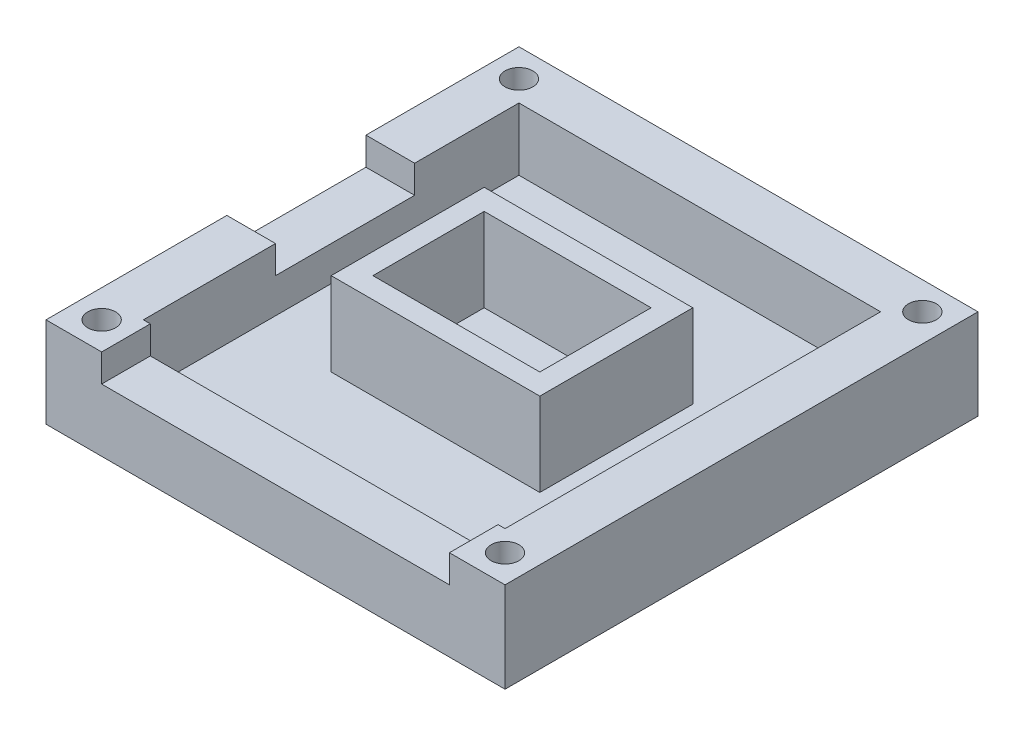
ISO-10303-21;
HEADER;
FILE_DESCRIPTION(('STEP AP214'),'2;1');
FILE_NAME('part.step','',(''),(''),'','','');
FILE_SCHEMA(('AUTOMOTIVE_DESIGN { 1 0 10303 214 1 1 1 1 }'));
ENDSEC;
DATA;
#1=APPLICATION_CONTEXT('core data for automotive mechanical design processes');
#2=APPLICATION_PROTOCOL_DEFINITION('international standard','automotive_design',2000,#1);
#3=PRODUCT_CONTEXT('',#1,'mechanical');
#4=PRODUCT('Part','Part','',(#3));
#5=PRODUCT_RELATED_PRODUCT_CATEGORY('part','',(#4));
#6=PRODUCT_DEFINITION_FORMATION('','',#4);
#7=PRODUCT_DEFINITION_CONTEXT('part definition',#1,'design');
#8=PRODUCT_DEFINITION('design','',#6,#7);
#9=PRODUCT_DEFINITION_SHAPE('','',#8);
#10=(LENGTH_UNIT() NAMED_UNIT(*) SI_UNIT(.MILLI.,.METRE.));
#11=(NAMED_UNIT(*) PLANE_ANGLE_UNIT() SI_UNIT($,.RADIAN.));
#12=(NAMED_UNIT(*) SI_UNIT($,.STERADIAN.) SOLID_ANGLE_UNIT());
#13=UNCERTAINTY_MEASURE_WITH_UNIT(LENGTH_MEASURE(1.E-05),#10,'distance_accuracy_value','');
#14=(GEOMETRIC_REPRESENTATION_CONTEXT(3) GLOBAL_UNCERTAINTY_ASSIGNED_CONTEXT((#13)) GLOBAL_UNIT_ASSIGNED_CONTEXT((#10,
#11,#12)) REPRESENTATION_CONTEXT('',''));
#15=CARTESIAN_POINT('',(0.,0.,0.));
#16=DIRECTION('',(0.,0.,1.));
#17=DIRECTION('',(1.,0.,0.));
#18=AXIS2_PLACEMENT_3D('',#15,#16,#17);
#19=CARTESIAN_POINT('',(0.,5.99999999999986,0.));
#20=DIRECTION('',(0.,-1.,0.));
#21=DIRECTION('',(0.,0.,-1.));
#22=AXIS2_PLACEMENT_3D('',#19,#20,#21);
#23=PLANE('',#22);
#24=DIRECTION('',(0.,0.,-1.));
#25=VECTOR('',#24,1.);
#26=CARTESIAN_POINT('',(13.,5.99999999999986,23.5));
#27=LINE('',#26,#25);
#28=CARTESIAN_POINT('',(13.,5.99999999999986,23.5));
#29=VERTEX_POINT('',#28);
#30=CARTESIAN_POINT('',(13.,5.99999999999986,-3.5));
#31=VERTEX_POINT('',#30);
#32=EDGE_CURVE('E426',#29,#31,#27,.T.);
#33=ORIENTED_EDGE('',*,*,#32,.T.);
#34=DIRECTION('',(-1.,0.,0.));
#35=VECTOR('',#34,1.);
#36=CARTESIAN_POINT('',(-13.,5.99999999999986,-3.5));
#37=LINE('',#36,#35);
#38=CARTESIAN_POINT('',(-13.,5.99999999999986,-3.5));
#39=VERTEX_POINT('',#38);
#40=EDGE_CURVE('E430',#31,#39,#37,.T.);
#41=ORIENTED_EDGE('',*,*,#40,.T.);
#42=DIRECTION('',(0.,0.,1.));
#43=VECTOR('',#42,1.);
#44=CARTESIAN_POINT('',(-13.,5.99999999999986,23.5));
#45=LINE('',#44,#43);
#46=CARTESIAN_POINT('',(-13.,5.99999999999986,23.5));
#47=VERTEX_POINT('',#46);
#48=EDGE_CURVE('E435',#39,#47,#45,.T.);
#49=ORIENTED_EDGE('',*,*,#48,.T.);
#50=DIRECTION('',(1.,0.,0.));
#51=VECTOR('',#50,1.);
#52=CARTESIAN_POINT('',(-13.,5.99999999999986,23.5));
#53=LINE('',#52,#51);
#54=EDGE_CURVE('E439',#47,#29,#53,.T.);
#55=ORIENTED_EDGE('',*,*,#54,.T.);
#56=EDGE_LOOP('',(#33,#41,#49,#55));
#57=FACE_BOUND('',#56,.T.);
#58=DIRECTION('',(0.,0.,-1.));
#59=VECTOR('',#58,1.);
#60=CARTESIAN_POINT('',(7.5,5.99999999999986,15.5));
#61=LINE('',#60,#59);
#62=CARTESIAN_POINT('',(7.5,5.99999999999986,15.5));
#63=VERTEX_POINT('',#62);
#64=CARTESIAN_POINT('',(7.5,5.99999999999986,4.5));
#65=VERTEX_POINT('',#64);
#66=EDGE_CURVE('E274',#63,#65,#61,.T.);
#67=ORIENTED_EDGE('',*,*,#66,.F.);
#68=DIRECTION('',(1.,0.,0.));
#69=VECTOR('',#68,1.);
#70=CARTESIAN_POINT('',(-7.5,5.99999999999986,15.5));
#71=LINE('',#70,#69);
#72=CARTESIAN_POINT('',(-7.5,5.99999999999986,15.5));
#73=VERTEX_POINT('',#72);
#74=EDGE_CURVE('E313',#73,#63,#71,.T.);
#75=ORIENTED_EDGE('',*,*,#74,.F.);
#76=DIRECTION('',(0.,0.,1.));
#77=VECTOR('',#76,1.);
#78=CARTESIAN_POINT('',(-7.5,5.99999999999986,15.5));
#79=LINE('',#78,#77);
#80=CARTESIAN_POINT('',(-7.5,5.99999999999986,4.5));
#81=VERTEX_POINT('',#80);
#82=EDGE_CURVE('E66',#81,#73,#79,.T.);
#83=ORIENTED_EDGE('',*,*,#82,.F.);
#84=DIRECTION('',(-1.,0.,0.));
#85=VECTOR('',#84,1.);
#86=CARTESIAN_POINT('',(-7.5,5.99999999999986,4.5));
#87=LINE('',#86,#85);
#88=EDGE_CURVE('E61',#65,#81,#87,.T.);
#89=ORIENTED_EDGE('',*,*,#88,.F.);
#90=EDGE_LOOP('',(#67,#75,#83,#89));
#91=FACE_BOUND('',#90,.T.);
#92=ADVANCED_FACE('F45',(#57,#91),#23,.F.);
#93=CARTESIAN_POINT('',(-16.5,10.4999999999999,20.));
#94=DIRECTION('',(0.,1.,0.));
#95=DIRECTION('',(0.,0.,1.));
#96=AXIS2_PLACEMENT_3D('',#93,#94,#95);
#97=PLANE('',#96);
#98=CARTESIAN_POINT('',(-14.5,10.4999999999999,25.));
#99=DIRECTION('',(0.,1.,0.));
#100=DIRECTION('',(0.,0.,-1.));
#101=AXIS2_PLACEMENT_3D('',#98,#99,#100);
#102=CIRCLE('',#101,1.);
#103=CARTESIAN_POINT('',(-14.5,10.4999999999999,24.));
#104=VERTEX_POINT('',#103);
#105=EDGE_CURVE('E365',#104,#104,#102,.T.);
#106=ORIENTED_EDGE('',*,*,#105,.F.);
#107=EDGE_LOOP('',(#106));
#108=FACE_BOUND('',#107,.T.);
#109=DIRECTION('',(1.,0.,0.));
#110=VECTOR('',#109,1.);
#111=CARTESIAN_POINT('',(-16.5,10.4999999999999,14.));
#112=LINE('',#111,#110);
#113=CARTESIAN_POINT('',(-16.5,10.4999999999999,14.));
#114=VERTEX_POINT('',#113);
#115=CARTESIAN_POINT('',(-13.,10.4999999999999,14.));
#116=VERTEX_POINT('',#115);
#117=EDGE_CURVE('E399',#114,#116,#112,.T.);
#118=ORIENTED_EDGE('',*,*,#117,.F.);
#119=DIRECTION('',(0.,0.,-1.));
#120=VECTOR('',#119,1.);
#121=CARTESIAN_POINT('',(-16.5,10.4999999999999,20.));
#122=LINE('',#121,#120);
#123=CARTESIAN_POINT('',(-16.5,10.4999999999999,27.));
#124=VERTEX_POINT('',#123);
#125=EDGE_CURVE('E568',#124,#114,#122,.T.);
#126=ORIENTED_EDGE('',*,*,#125,.F.);
#127=DIRECTION('',(-1.,0.,0.));
#128=VECTOR('',#127,1.);
#129=CARTESIAN_POINT('',(-16.5,10.4999999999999,27.));
#130=LINE('',#129,#128);
#131=CARTESIAN_POINT('',(-12.5,10.4999999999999,27.));
#132=VERTEX_POINT('',#131);
#133=EDGE_CURVE('E498',#132,#124,#130,.T.);
#134=ORIENTED_EDGE('',*,*,#133,.F.);
#135=DIRECTION('',(0.,0.,1.));
#136=VECTOR('',#135,1.);
#137=CARTESIAN_POINT('',(-12.5,10.4999999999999,20.));
#138=LINE('',#137,#136);
#139=CARTESIAN_POINT('',(-12.5,10.4999999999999,23.5));
#140=VERTEX_POINT('',#139);
#141=EDGE_CURVE('E417',#140,#132,#138,.T.);
#142=ORIENTED_EDGE('',*,*,#141,.F.);
#143=DIRECTION('',(1.,0.,0.));
#144=VECTOR('',#143,1.);
#145=CARTESIAN_POINT('',(-13.,10.4999999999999,23.5));
#146=LINE('',#145,#144);
#147=CARTESIAN_POINT('',(-13.,10.4999999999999,23.5));
#148=VERTEX_POINT('',#147);
#149=EDGE_CURVE('E431',#148,#140,#146,.T.);
#150=ORIENTED_EDGE('',*,*,#149,.F.);
#151=DIRECTION('',(0.,0.,1.));
#152=VECTOR('',#151,1.);
#153=CARTESIAN_POINT('',(-13.,10.4999999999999,23.5));
#154=LINE('',#153,#152);
#155=EDGE_CURVE('E450',#116,#148,#154,.T.);
#156=ORIENTED_EDGE('',*,*,#155,.F.);
#157=EDGE_LOOP('',(#118,#126,#134,#142,#150,#156));
#158=FACE_BOUND('',#157,.T.);
#159=ADVANCED_FACE('F637',(#108,#158),#97,.T.);
#160=CARTESIAN_POINT('',(0.,0.,0.));
#161=DIRECTION('',(0.,0.,1.));
#162=DIRECTION('',(1.,0.,0.));
#163=AXIS2_PLACEMENT_3D('',#160,#161,#162);
#164=PLANE('',#163);
#165=DIRECTION('',(-1.,0.,0.));
#166=VECTOR('',#165,1.);
#167=CARTESIAN_POINT('',(16.5,3.99999999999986,0.));
#168=LINE('',#167,#166);
#169=CARTESIAN_POINT('',(7.75000000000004,3.99999999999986,0.));
#170=VERTEX_POINT('',#169);
#171=CARTESIAN_POINT('',(-7.74999999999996,3.99999999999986,0.));
#172=VERTEX_POINT('',#171);
#173=EDGE_CURVE('E490',#170,#172,#168,.T.);
#174=ORIENTED_EDGE('',*,*,#173,.F.);
#175=DIRECTION('',(0.,-1.,0.));
#176=VECTOR('',#175,1.);
#177=CARTESIAN_POINT('',(7.75000000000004,3.99999999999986,0.));
#178=LINE('',#177,#176);
#179=CARTESIAN_POINT('',(7.75000000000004,2.09999999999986,0.));
#180=VERTEX_POINT('',#179);
#181=EDGE_CURVE('E520',#170,#180,#178,.T.);
#182=ORIENTED_EDGE('',*,*,#181,.T.);
#183=DIRECTION('',(1.,0.,0.));
#184=VECTOR('',#183,1.);
#185=CARTESIAN_POINT('',(7.75000000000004,2.09999999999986,0.));
#186=LINE('',#185,#184);
#187=CARTESIAN_POINT('',(9.75000000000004,2.09999999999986,0.));
#188=VERTEX_POINT('',#187);
#189=EDGE_CURVE('E561',#180,#188,#186,.T.);
#190=ORIENTED_EDGE('',*,*,#189,.T.);
#191=DIRECTION('',(0.,-1.,0.));
#192=VECTOR('',#191,1.);
#193=CARTESIAN_POINT('',(9.75000000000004,2.09999999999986,0.));
#194=LINE('',#193,#192);
#195=CARTESIAN_POINT('',(9.74999999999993,-1.41596803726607E-13,0.));
#196=VERTEX_POINT('',#195);
#197=EDGE_CURVE('E557',#188,#196,#194,.T.);
#198=ORIENTED_EDGE('',*,*,#197,.T.);
#199=DIRECTION('',(1.,0.,0.));
#200=VECTOR('',#199,1.);
#201=CARTESIAN_POINT('',(-9.74999999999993,-1.41596803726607E-13,0.));
#202=LINE('',#201,#200);
#203=CARTESIAN_POINT('',(-9.74999999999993,-1.41596803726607E-13,0.));
#204=VERTEX_POINT('',#203);
#205=EDGE_CURVE('E553',#204,#196,#202,.T.);
#206=ORIENTED_EDGE('',*,*,#205,.F.);
#207=DIRECTION('',(0.,-1.,0.));
#208=VECTOR('',#207,1.);
#209=CARTESIAN_POINT('',(-9.74999999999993,2.09999999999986,0.));
#210=LINE('',#209,#208);
#211=CARTESIAN_POINT('',(-9.74999999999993,2.09999999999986,0.));
#212=VERTEX_POINT('',#211);
#213=EDGE_CURVE('E550',#212,#204,#210,.T.);
#214=ORIENTED_EDGE('',*,*,#213,.F.);
#215=DIRECTION('',(1.,0.,0.));
#216=VECTOR('',#215,1.);
#217=CARTESIAN_POINT('',(-9.74999999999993,2.09999999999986,0.));
#218=LINE('',#217,#216);
#219=CARTESIAN_POINT('',(-7.74999999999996,2.09999999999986,0.));
#220=VERTEX_POINT('',#219);
#221=EDGE_CURVE('E546',#212,#220,#218,.T.);
#222=ORIENTED_EDGE('',*,*,#221,.T.);
#223=DIRECTION('',(0.,-1.,0.));
#224=VECTOR('',#223,1.);
#225=CARTESIAN_POINT('',(-7.74999999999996,3.99999999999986,0.));
#226=LINE('',#225,#224);
#227=EDGE_CURVE('E511',#172,#220,#226,.T.);
#228=ORIENTED_EDGE('',*,*,#227,.F.);
#229=EDGE_LOOP('',(#174,#182,#190,#198,#206,#214,#222,#228));
#230=FACE_BOUND('',#229,.T.);
#231=ADVANCED_FACE('F715',(#230),#164,.F.);
#232=CARTESIAN_POINT('',(-16.5,10.4999999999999,20.));
#233=DIRECTION('',(1.,0.,0.));
#234=DIRECTION('',(0.,1.,0.));
#235=AXIS2_PLACEMENT_3D('',#232,#233,#234);
#236=PLANE('',#235);
#237=ORIENTED_EDGE('',*,*,#125,.T.);
#238=DIRECTION('',(0.,1.,0.));
#239=VECTOR('',#238,1.);
#240=CARTESIAN_POINT('',(-16.5,8.49999999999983,14.));
#241=LINE('',#240,#239);
#242=CARTESIAN_POINT('',(-16.5,8.49999999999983,14.));
#243=VERTEX_POINT('',#242);
#244=EDGE_CURVE('E376',#243,#114,#241,.T.);
#245=ORIENTED_EDGE('',*,*,#244,.F.);
#246=DIRECTION('',(0.,0.,1.));
#247=VECTOR('',#246,1.);
#248=CARTESIAN_POINT('',(-16.5,8.49999999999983,4.));
#249=LINE('',#248,#247);
#250=CARTESIAN_POINT('',(-16.5,8.49999999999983,4.));
#251=VERTEX_POINT('',#250);
#252=EDGE_CURVE('E386',#251,#243,#249,.T.);
#253=ORIENTED_EDGE('',*,*,#252,.F.);
#254=DIRECTION('',(0.,-1.,0.));
#255=VECTOR('',#254,1.);
#256=CARTESIAN_POINT('',(-16.5,8.49999999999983,4.));
#257=LINE('',#256,#255);
#258=CARTESIAN_POINT('',(-16.5,10.4999999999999,4.));
#259=VERTEX_POINT('',#258);
#260=EDGE_CURVE('E382',#259,#251,#257,.T.);
#261=ORIENTED_EDGE('',*,*,#260,.F.);
#262=CARTESIAN_POINT('',(-16.5,10.4999999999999,-7.));
#263=VERTEX_POINT('',#262);
#264=EDGE_CURVE('E542',#259,#263,#122,.T.);
#265=ORIENTED_EDGE('',*,*,#264,.T.);
#266=DIRECTION('',(0.,1.,0.));
#267=VECTOR('',#266,1.);
#268=CARTESIAN_POINT('',(-16.5,3.99999999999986,-7.));
#269=LINE('',#268,#267);
#270=CARTESIAN_POINT('',(-16.5,3.99999999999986,-7.));
#271=VERTEX_POINT('',#270);
#272=EDGE_CURVE('E463',#271,#263,#269,.T.);
#273=ORIENTED_EDGE('',*,*,#272,.F.);
#274=DIRECTION('',(0.,0.,-1.));
#275=VECTOR('',#274,1.);
#276=CARTESIAN_POINT('',(-16.5,3.99999999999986,20.));
#277=LINE('',#276,#275);
#278=CARTESIAN_POINT('',(-16.5,3.99999999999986,27.));
#279=VERTEX_POINT('',#278);
#280=EDGE_CURVE('E515',#279,#271,#277,.T.);
#281=ORIENTED_EDGE('',*,*,#280,.F.);
#282=DIRECTION('',(0.,-1.,0.));
#283=VECTOR('',#282,1.);
#284=CARTESIAN_POINT('',(-16.5,3.99999999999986,27.));
#285=LINE('',#284,#283);
#286=EDGE_CURVE('E503',#124,#279,#285,.T.);
#287=ORIENTED_EDGE('',*,*,#286,.F.);
#288=EDGE_LOOP('',(#237,#245,#253,#261,#265,#273,#281,#287));
#289=FACE_BOUND('',#288,.T.);
#290=ADVANCED_FACE('F47',(#289),#236,.F.);
#291=CARTESIAN_POINT('',(-7.74999999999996,3.99999999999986,20.));
#292=DIRECTION('',(1.,0.,0.));
#293=DIRECTION('',(0.,1.,0.));
#294=AXIS2_PLACEMENT_3D('',#291,#292,#293);
#295=PLANE('',#294);
#296=ORIENTED_EDGE('',*,*,#227,.T.);
#297=DIRECTION('',(0.,0.,-1.));
#298=VECTOR('',#297,1.);
#299=CARTESIAN_POINT('',(-7.74999999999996,2.09999999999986,20.));
#300=LINE('',#299,#298);
#301=CARTESIAN_POINT('',(-7.74999999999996,2.09999999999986,20.));
#302=VERTEX_POINT('',#301);
#303=EDGE_CURVE('E598',#302,#220,#300,.T.);
#304=ORIENTED_EDGE('',*,*,#303,.F.);
#305=DIRECTION('',(0.,-1.,0.));
#306=VECTOR('',#305,1.);
#307=CARTESIAN_POINT('',(-7.74999999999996,3.99999999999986,20.));
#308=LINE('',#307,#306);
#309=CARTESIAN_POINT('',(-7.74999999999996,3.99999999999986,20.));
#310=VERTEX_POINT('',#309);
#311=EDGE_CURVE('E516',#310,#302,#308,.T.);
#312=ORIENTED_EDGE('',*,*,#311,.F.);
#313=DIRECTION('',(0.,0.,-1.));
#314=VECTOR('',#313,1.);
#315=CARTESIAN_POINT('',(-7.74999999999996,3.99999999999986,20.));
#316=LINE('',#315,#314);
#317=EDGE_CURVE('E601',#310,#172,#316,.T.);
#318=ORIENTED_EDGE('',*,*,#317,.T.);
#319=EDGE_LOOP('',(#296,#304,#312,#318));
#320=FACE_BOUND('',#319,.T.);
#321=ADVANCED_FACE('F848',(#320),#295,.F.);
#322=CARTESIAN_POINT('',(-9.74999999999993,2.09999999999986,20.));
#323=DIRECTION('',(0.,1.,0.));
#324=DIRECTION('',(0.,0.,1.));
#325=AXIS2_PLACEMENT_3D('',#322,#323,#324);
#326=PLANE('',#325);
#327=ORIENTED_EDGE('',*,*,#221,.F.);
#328=DIRECTION('',(0.,0.,-1.));
#329=VECTOR('',#328,1.);
#330=CARTESIAN_POINT('',(-9.74999999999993,2.09999999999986,20.));
#331=LINE('',#330,#329);
#332=CARTESIAN_POINT('',(-9.74999999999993,2.09999999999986,20.));
#333=VERTEX_POINT('',#332);
#334=EDGE_CURVE('E595',#333,#212,#331,.T.);
#335=ORIENTED_EDGE('',*,*,#334,.F.);
#336=DIRECTION('',(1.,0.,0.));
#337=VECTOR('',#336,1.);
#338=CARTESIAN_POINT('',(-9.74999999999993,2.09999999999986,20.));
#339=LINE('',#338,#337);
#340=EDGE_CURVE('E519',#333,#302,#339,.T.);
#341=ORIENTED_EDGE('',*,*,#340,.T.);
#342=ORIENTED_EDGE('',*,*,#303,.T.);
#343=EDGE_LOOP('',(#327,#335,#341,#342));
#344=FACE_BOUND('',#343,.T.);
#345=ADVANCED_FACE('F845',(#344),#326,.T.);
#346=CARTESIAN_POINT('',(-9.74999999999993,2.09999999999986,20.));
#347=DIRECTION('',(1.,0.,0.));
#348=DIRECTION('',(0.,0.,-1.));
#349=AXIS2_PLACEMENT_3D('',#346,#347,#348);
#350=PLANE('',#349);
#351=ORIENTED_EDGE('',*,*,#213,.T.);
#352=DIRECTION('',(0.,0.,-1.));
#353=VECTOR('',#352,1.);
#354=CARTESIAN_POINT('',(-9.74999999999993,-1.41596803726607E-13,20.));
#355=LINE('',#354,#353);
#356=CARTESIAN_POINT('',(-9.74999999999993,-1.41596803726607E-13,20.));
#357=VERTEX_POINT('',#356);
#358=EDGE_CURVE('E591',#357,#204,#355,.T.);
#359=ORIENTED_EDGE('',*,*,#358,.F.);
#360=DIRECTION('',(0.,-1.,0.));
#361=VECTOR('',#360,1.);
#362=CARTESIAN_POINT('',(-9.74999999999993,2.09999999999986,20.));
#363=LINE('',#362,#361);
#364=EDGE_CURVE('E524',#333,#357,#363,.T.);
#365=ORIENTED_EDGE('',*,*,#364,.F.);
#366=ORIENTED_EDGE('',*,*,#334,.T.);
#367=EDGE_LOOP('',(#351,#359,#365,#366));
#368=FACE_BOUND('',#367,.T.);
#369=ADVANCED_FACE('F841',(#368),#350,.F.);
#370=CARTESIAN_POINT('',(-9.74999999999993,-1.41596803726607E-13,20.));
#371=DIRECTION('',(0.,1.,0.));
#372=DIRECTION('',(-1.,0.,0.));
#373=AXIS2_PLACEMENT_3D('',#370,#371,#372);
#374=PLANE('',#373);
#375=ORIENTED_EDGE('',*,*,#205,.T.);
#376=DIRECTION('',(0.,0.,-1.));
#377=VECTOR('',#376,1.);
#378=CARTESIAN_POINT('',(9.74999999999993,-1.41596803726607E-13,20.));
#379=LINE('',#378,#377);
#380=CARTESIAN_POINT('',(9.74999999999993,-1.41596803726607E-13,20.));
#381=VERTEX_POINT('',#380);
#382=EDGE_CURVE('E588',#381,#196,#379,.T.);
#383=ORIENTED_EDGE('',*,*,#382,.F.);
#384=DIRECTION('',(1.,0.,0.));
#385=VECTOR('',#384,1.);
#386=CARTESIAN_POINT('',(-9.74999999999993,-1.41596803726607E-13,20.));
#387=LINE('',#386,#385);
#388=EDGE_CURVE('E527',#357,#381,#387,.T.);
#389=ORIENTED_EDGE('',*,*,#388,.F.);
#390=ORIENTED_EDGE('',*,*,#358,.T.);
#391=EDGE_LOOP('',(#375,#383,#389,#390));
#392=FACE_BOUND('',#391,.T.);
#393=ADVANCED_FACE('F837',(#392),#374,.F.);
#394=CARTESIAN_POINT('',(9.75000000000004,2.09999999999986,20.));
#395=DIRECTION('',(1.,0.,0.));
#396=DIRECTION('',(0.,1.,0.));
#397=AXIS2_PLACEMENT_3D('',#394,#395,#396);
#398=PLANE('',#397);
#399=ORIENTED_EDGE('',*,*,#197,.F.);
#400=DIRECTION('',(0.,0.,-1.));
#401=VECTOR('',#400,1.);
#402=CARTESIAN_POINT('',(9.75000000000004,2.09999999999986,20.));
#403=LINE('',#402,#401);
#404=CARTESIAN_POINT('',(9.75000000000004,2.09999999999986,20.));
#405=VERTEX_POINT('',#404);
#406=EDGE_CURVE('E585',#405,#188,#403,.T.);
#407=ORIENTED_EDGE('',*,*,#406,.F.);
#408=DIRECTION('',(0.,-1.,0.));
#409=VECTOR('',#408,1.);
#410=CARTESIAN_POINT('',(9.75000000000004,2.09999999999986,20.));
#411=LINE('',#410,#409);
#412=EDGE_CURVE('E530',#405,#381,#411,.T.);
#413=ORIENTED_EDGE('',*,*,#412,.T.);
#414=ORIENTED_EDGE('',*,*,#382,.T.);
#415=EDGE_LOOP('',(#399,#407,#413,#414));
#416=FACE_BOUND('',#415,.T.);
#417=ADVANCED_FACE('F833',(#416),#398,.T.);
#418=CARTESIAN_POINT('',(7.75000000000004,2.09999999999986,20.));
#419=DIRECTION('',(0.,1.,0.));
#420=DIRECTION('',(0.,0.,1.));
#421=AXIS2_PLACEMENT_3D('',#418,#419,#420);
#422=PLANE('',#421);
#423=ORIENTED_EDGE('',*,*,#189,.F.);
#424=DIRECTION('',(0.,0.,-1.));
#425=VECTOR('',#424,1.);
#426=CARTESIAN_POINT('',(7.75000000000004,2.09999999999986,20.));
#427=LINE('',#426,#425);
#428=CARTESIAN_POINT('',(7.75000000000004,2.09999999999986,20.));
#429=VERTEX_POINT('',#428);
#430=EDGE_CURVE('E582',#429,#180,#427,.T.);
#431=ORIENTED_EDGE('',*,*,#430,.F.);
#432=DIRECTION('',(1.,0.,0.));
#433=VECTOR('',#432,1.);
#434=CARTESIAN_POINT('',(7.75000000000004,2.09999999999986,20.));
#435=LINE('',#434,#433);
#436=EDGE_CURVE('E534',#429,#405,#435,.T.);
#437=ORIENTED_EDGE('',*,*,#436,.T.);
#438=ORIENTED_EDGE('',*,*,#406,.T.);
#439=EDGE_LOOP('',(#423,#431,#437,#438));
#440=FACE_BOUND('',#439,.T.);
#441=ADVANCED_FACE('F829',(#440),#422,.T.);
#442=CARTESIAN_POINT('',(7.75000000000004,3.99999999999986,20.));
#443=DIRECTION('',(1.,0.,0.));
#444=DIRECTION('',(0.,1.,0.));
#445=AXIS2_PLACEMENT_3D('',#442,#443,#444);
#446=PLANE('',#445);
#447=ORIENTED_EDGE('',*,*,#181,.F.);
#448=DIRECTION('',(0.,0.,-1.));
#449=VECTOR('',#448,1.);
#450=CARTESIAN_POINT('',(7.75000000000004,3.99999999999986,20.));
#451=LINE('',#450,#449);
#452=CARTESIAN_POINT('',(7.75000000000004,3.99999999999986,20.));
#453=VERTEX_POINT('',#452);
#454=EDGE_CURVE('E578',#453,#170,#451,.T.);
#455=ORIENTED_EDGE('',*,*,#454,.F.);
#456=DIRECTION('',(0.,-1.,0.));
#457=VECTOR('',#456,1.);
#458=CARTESIAN_POINT('',(7.75000000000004,3.99999999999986,20.));
#459=LINE('',#458,#457);
#460=EDGE_CURVE('E538',#453,#429,#459,.T.);
#461=ORIENTED_EDGE('',*,*,#460,.T.);
#462=ORIENTED_EDGE('',*,*,#430,.T.);
#463=EDGE_LOOP('',(#447,#455,#461,#462));
#464=FACE_BOUND('',#463,.T.);
#465=ADVANCED_FACE('F826',(#464),#446,.T.);
#466=CARTESIAN_POINT('',(7.75000000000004,3.99999999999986,20.));
#467=DIRECTION('',(0.,1.,0.));
#468=DIRECTION('',(0.,0.,1.));
#469=AXIS2_PLACEMENT_3D('',#466,#467,#468);
#470=PLANE('',#469);
#471=DIRECTION('',(-1.,0.,0.));
#472=VECTOR('',#471,1.);
#473=CARTESIAN_POINT('',(16.5,3.99999999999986,-7.));
#474=LINE('',#473,#472);
#475=CARTESIAN_POINT('',(16.5,3.99999999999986,-7.));
#476=VERTEX_POINT('',#475);
#477=EDGE_CURVE('E485',#476,#271,#474,.T.);
#478=ORIENTED_EDGE('',*,*,#477,.F.);
#479=DIRECTION('',(0.,0.,-1.));
#480=VECTOR('',#479,1.);
#481=CARTESIAN_POINT('',(16.5,3.99999999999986,20.));
#482=LINE('',#481,#480);
#483=CARTESIAN_POINT('',(16.5,3.99999999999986,27.));
#484=VERTEX_POINT('',#483);
#485=EDGE_CURVE('E575',#484,#476,#482,.T.);
#486=ORIENTED_EDGE('',*,*,#485,.F.);
#487=DIRECTION('',(1.,0.,0.));
#488=VECTOR('',#487,1.);
#489=CARTESIAN_POINT('',(-16.5,3.99999999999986,27.));
#490=LINE('',#489,#488);
#491=EDGE_CURVE('E507',#279,#484,#490,.T.);
#492=ORIENTED_EDGE('',*,*,#491,.F.);
#493=ORIENTED_EDGE('',*,*,#280,.T.);
#494=EDGE_LOOP('',(#478,#486,#492,#493));
#495=FACE_BOUND('',#494,.T.);
#496=ORIENTED_EDGE('',*,*,#454,.T.);
#497=ORIENTED_EDGE('',*,*,#173,.T.);
#498=ORIENTED_EDGE('',*,*,#317,.F.);
#499=DIRECTION('',(1.,0.,0.));
#500=VECTOR('',#499,1.);
#501=CARTESIAN_POINT('',(-16.5,3.99999999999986,20.));
#502=LINE('',#501,#500);
#503=EDGE_CURVE('E494',#310,#453,#502,.T.);
#504=ORIENTED_EDGE('',*,*,#503,.T.);
#505=EDGE_LOOP('',(#496,#497,#498,#504));
#506=FACE_BOUND('',#505,.T.);
#507=ADVANCED_FACE('F650',(#495,#506),#470,.F.);
#508=CARTESIAN_POINT('',(16.5,10.4999999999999,20.));
#509=DIRECTION('',(1.,0.,0.));
#510=DIRECTION('',(0.,1.,0.));
#511=AXIS2_PLACEMENT_3D('',#508,#509,#510);
#512=PLANE('',#511);
#513=ORIENTED_EDGE('',*,*,#485,.T.);
#514=DIRECTION('',(0.,-1.,0.));
#515=VECTOR('',#514,1.);
#516=CARTESIAN_POINT('',(16.5,3.99999999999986,-7.));
#517=LINE('',#516,#515);
#518=CARTESIAN_POINT('',(16.5,10.4999999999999,-7.));
#519=VERTEX_POINT('',#518);
#520=EDGE_CURVE('E481',#519,#476,#517,.T.);
#521=ORIENTED_EDGE('',*,*,#520,.F.);
#522=DIRECTION('',(0.,0.,-1.));
#523=VECTOR('',#522,1.);
#524=CARTESIAN_POINT('',(16.5,10.4999999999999,20.));
#525=LINE('',#524,#523);
#526=CARTESIAN_POINT('',(16.5,10.4999999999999,27.));
#527=VERTEX_POINT('',#526);
#528=EDGE_CURVE('E572',#527,#519,#525,.T.);
#529=ORIENTED_EDGE('',*,*,#528,.F.);
#530=DIRECTION('',(0.,1.,0.));
#531=VECTOR('',#530,1.);
#532=CARTESIAN_POINT('',(16.5,3.99999999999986,27.));
#533=LINE('',#532,#531);
#534=EDGE_CURVE('E489',#484,#527,#533,.T.);
#535=ORIENTED_EDGE('',*,*,#534,.F.);
#536=EDGE_LOOP('',(#513,#521,#529,#535));
#537=FACE_BOUND('',#536,.T.);
#538=ADVANCED_FACE('F654',(#537),#512,.T.);
#539=CARTESIAN_POINT('',(14.5,10.4999999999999,25.));
#540=DIRECTION('',(0.,1.,0.));
#541=DIRECTION('',(0.,0.,1.));
#542=AXIS2_PLACEMENT_3D('',#539,#540,#541);
#543=CIRCLE('',#542,1.);
#544=CARTESIAN_POINT('',(14.5,10.4999999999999,26.));
#545=VERTEX_POINT('',#544);
#546=EDGE_CURVE('E357',#545,#545,#543,.T.);
#547=ORIENTED_EDGE('',*,*,#546,.F.);
#548=EDGE_LOOP('',(#547));
#549=FACE_BOUND('',#548,.T.);
#550=CARTESIAN_POINT('',(14.5,10.4999999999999,-5.));
#551=DIRECTION('',(0.,1.,0.));
#552=DIRECTION('',(0.,0.,-1.));
#553=AXIS2_PLACEMENT_3D('',#550,#551,#552);
#554=CIRCLE('',#553,1.);
#555=CARTESIAN_POINT('',(14.5,10.4999999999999,-6.));
#556=VERTEX_POINT('',#555);
#557=EDGE_CURVE('E348',#556,#556,#554,.T.);
#558=ORIENTED_EDGE('',*,*,#557,.F.);
#559=EDGE_LOOP('',(#558));
#560=FACE_BOUND('',#559,.T.);
#561=CARTESIAN_POINT('',(-14.5,10.4999999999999,-5.));
#562=DIRECTION('',(0.,1.,0.));
#563=DIRECTION('',(0.,0.,1.));
#564=AXIS2_PLACEMENT_3D('',#561,#562,#563);
#565=CIRCLE('',#564,1.);
#566=CARTESIAN_POINT('',(-14.5,10.4999999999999,-4.));
#567=VERTEX_POINT('',#566);
#568=EDGE_CURVE('E352',#567,#567,#565,.T.);
#569=ORIENTED_EDGE('',*,*,#568,.F.);
#570=EDGE_LOOP('',(#569));
#571=FACE_BOUND('',#570,.T.);
#572=DIRECTION('',(-1.,0.,0.));
#573=VECTOR('',#572,1.);
#574=CARTESIAN_POINT('',(-16.5,10.4999999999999,4.));
#575=LINE('',#574,#573);
#576=CARTESIAN_POINT('',(-13.,10.4999999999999,4.));
#577=VERTEX_POINT('',#576);
#578=EDGE_CURVE('E394',#577,#259,#575,.T.);
#579=ORIENTED_EDGE('',*,*,#578,.F.);
#580=CARTESIAN_POINT('',(-13.,10.4999999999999,-3.5));
#581=VERTEX_POINT('',#580);
#582=EDGE_CURVE('E451',#581,#577,#154,.T.);
#583=ORIENTED_EDGE('',*,*,#582,.F.);
#584=DIRECTION('',(-1.,0.,0.));
#585=VECTOR('',#584,1.);
#586=CARTESIAN_POINT('',(-13.,10.4999999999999,-3.5));
#587=LINE('',#586,#585);
#588=CARTESIAN_POINT('',(13.,10.4999999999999,-3.5));
#589=VERTEX_POINT('',#588);
#590=EDGE_CURVE('E446',#589,#581,#587,.T.);
#591=ORIENTED_EDGE('',*,*,#590,.F.);
#592=DIRECTION('',(0.,0.,-1.));
#593=VECTOR('',#592,1.);
#594=CARTESIAN_POINT('',(13.,10.4999999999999,23.5));
#595=LINE('',#594,#593);
#596=CARTESIAN_POINT('',(13.,10.4999999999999,23.5));
#597=VERTEX_POINT('',#596);
#598=EDGE_CURVE('E425',#597,#589,#595,.T.);
#599=ORIENTED_EDGE('',*,*,#598,.F.);
#600=CARTESIAN_POINT('',(12.5,10.4999999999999,23.5));
#601=VERTEX_POINT('',#600);
#602=EDGE_CURVE('E455',#601,#597,#146,.T.);
#603=ORIENTED_EDGE('',*,*,#602,.F.);
#604=DIRECTION('',(0.,0.,-1.));
#605=VECTOR('',#604,1.);
#606=CARTESIAN_POINT('',(12.5,10.4999999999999,20.));
#607=LINE('',#606,#605);
#608=CARTESIAN_POINT('',(12.5,10.4999999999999,27.));
#609=VERTEX_POINT('',#608);
#610=EDGE_CURVE('E422',#609,#601,#607,.T.);
#611=ORIENTED_EDGE('',*,*,#610,.F.);
#612=EDGE_CURVE('E499',#527,#609,#130,.T.);
#613=ORIENTED_EDGE('',*,*,#612,.F.);
#614=ORIENTED_EDGE('',*,*,#528,.T.);
#615=DIRECTION('',(1.,0.,0.));
#616=VECTOR('',#615,1.);
#617=CARTESIAN_POINT('',(16.5,10.4999999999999,-7.));
#618=LINE('',#617,#616);
#619=EDGE_CURVE('E477',#263,#519,#618,.T.);
#620=ORIENTED_EDGE('',*,*,#619,.F.);
#621=ORIENTED_EDGE('',*,*,#264,.F.);
#622=EDGE_LOOP('',(#579,#583,#591,#599,#603,#611,#613,#614,#620,#621));
#623=FACE_BOUND('',#622,.T.);
#624=ADVANCED_FACE('F661',(#549,#560,#571,#623),#97,.T.);
#625=CARTESIAN_POINT('',(0.,0.,20.));
#626=DIRECTION('',(0.,0.,1.));
#627=DIRECTION('',(1.,0.,0.));
#628=AXIS2_PLACEMENT_3D('',#625,#626,#627);
#629=PLANE('',#628);
#630=ORIENTED_EDGE('',*,*,#503,.F.);
#631=ORIENTED_EDGE('',*,*,#311,.T.);
#632=ORIENTED_EDGE('',*,*,#340,.F.);
#633=ORIENTED_EDGE('',*,*,#364,.T.);
#634=ORIENTED_EDGE('',*,*,#388,.T.);
#635=ORIENTED_EDGE('',*,*,#412,.F.);
#636=ORIENTED_EDGE('',*,*,#436,.F.);
#637=ORIENTED_EDGE('',*,*,#460,.F.);
#638=EDGE_LOOP('',(#630,#631,#632,#633,#634,#635,#636,#637));
#639=FACE_BOUND('',#638,.T.);
#640=ADVANCED_FACE('F813',(#639),#629,.T.);
#641=CARTESIAN_POINT('',(0.,0.,27.));
#642=DIRECTION('',(0.,0.,-1.));
#643=DIRECTION('',(-1.,0.,0.));
#644=AXIS2_PLACEMENT_3D('',#641,#642,#643);
#645=PLANE('',#644);
#646=ORIENTED_EDGE('',*,*,#612,.T.);
#647=DIRECTION('',(0.,1.,0.));
#648=VECTOR('',#647,1.);
#649=CARTESIAN_POINT('',(12.5,12.4999999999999,27.));
#650=LINE('',#649,#648);
#651=CARTESIAN_POINT('',(12.5,8.49999999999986,27.));
#652=VERTEX_POINT('',#651);
#653=EDGE_CURVE('E402',#652,#609,#650,.T.);
#654=ORIENTED_EDGE('',*,*,#653,.F.);
#655=DIRECTION('',(1.,0.,0.));
#656=VECTOR('',#655,1.);
#657=CARTESIAN_POINT('',(-12.5,8.49999999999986,27.));
#658=LINE('',#657,#656);
#659=CARTESIAN_POINT('',(-12.5,8.49999999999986,27.));
#660=VERTEX_POINT('',#659);
#661=EDGE_CURVE('E409',#660,#652,#658,.T.);
#662=ORIENTED_EDGE('',*,*,#661,.F.);
#663=DIRECTION('',(0.,-1.,0.));
#664=VECTOR('',#663,1.);
#665=CARTESIAN_POINT('',(-12.5,12.4999999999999,27.));
#666=LINE('',#665,#664);
#667=EDGE_CURVE('E405',#132,#660,#666,.T.);
#668=ORIENTED_EDGE('',*,*,#667,.F.);
#669=ORIENTED_EDGE('',*,*,#133,.T.);
#670=ORIENTED_EDGE('',*,*,#286,.T.);
#671=ORIENTED_EDGE('',*,*,#491,.T.);
#672=ORIENTED_EDGE('',*,*,#534,.T.);
#673=EDGE_LOOP('',(#646,#654,#662,#668,#669,#670,#671,#672));
#674=FACE_BOUND('',#673,.T.);
#675=ADVANCED_FACE('F645',(#674),#645,.F.);
#676=CARTESIAN_POINT('',(0.,0.,-7.));
#677=DIRECTION('',(0.,0.,1.));
#678=DIRECTION('',(1.,0.,0.));
#679=AXIS2_PLACEMENT_3D('',#676,#677,#678);
#680=PLANE('',#679);
#681=ORIENTED_EDGE('',*,*,#272,.T.);
#682=ORIENTED_EDGE('',*,*,#619,.T.);
#683=ORIENTED_EDGE('',*,*,#520,.T.);
#684=ORIENTED_EDGE('',*,*,#477,.T.);
#685=EDGE_LOOP('',(#681,#682,#683,#684));
#686=FACE_BOUND('',#685,.T.);
#687=ADVANCED_FACE('F656',(#686),#680,.F.);
#688=CARTESIAN_POINT('',(13.,5.99999999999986,23.5));
#689=DIRECTION('',(1.,0.,0.));
#690=DIRECTION('',(0.,0.,-1.));
#691=AXIS2_PLACEMENT_3D('',#688,#689,#690);
#692=PLANE('',#691);
#693=ORIENTED_EDGE('',*,*,#598,.T.);
#694=DIRECTION('',(0.,1.,0.));
#695=VECTOR('',#694,1.);
#696=CARTESIAN_POINT('',(13.,5.99999999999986,-3.5));
#697=LINE('',#696,#695);
#698=EDGE_CURVE('E443',#31,#589,#697,.T.);
#699=ORIENTED_EDGE('',*,*,#698,.F.);
#700=ORIENTED_EDGE('',*,*,#32,.F.);
#701=DIRECTION('',(0.,1.,0.));
#702=VECTOR('',#701,1.);
#703=CARTESIAN_POINT('',(13.,5.99999999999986,23.5));
#704=LINE('',#703,#702);
#705=EDGE_CURVE('E459',#29,#597,#704,.T.);
#706=ORIENTED_EDGE('',*,*,#705,.T.);
#707=EDGE_LOOP('',(#693,#699,#700,#706));
#708=FACE_BOUND('',#707,.T.);
#709=ADVANCED_FACE('F807',(#708),#692,.F.);
#710=CARTESIAN_POINT('',(-13.,5.99999999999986,23.5));
#711=DIRECTION('',(0.,0.,1.));
#712=DIRECTION('',(1.,0.,0.));
#713=AXIS2_PLACEMENT_3D('',#710,#711,#712);
#714=PLANE('',#713);
#715=DIRECTION('',(1.,0.,0.));
#716=VECTOR('',#715,1.);
#717=CARTESIAN_POINT('',(-13.,8.49999999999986,23.5));
#718=LINE('',#717,#716);
#719=CARTESIAN_POINT('',(-12.5,8.49999999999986,23.5));
#720=VERTEX_POINT('',#719);
#721=CARTESIAN_POINT('',(12.5,8.49999999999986,23.5));
#722=VERTEX_POINT('',#721);
#723=EDGE_CURVE('E610',#720,#722,#718,.T.);
#724=ORIENTED_EDGE('',*,*,#723,.T.);
#725=DIRECTION('',(0.,1.,0.));
#726=VECTOR('',#725,1.);
#727=CARTESIAN_POINT('',(12.5,5.99999999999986,23.5));
#728=LINE('',#727,#726);
#729=EDGE_CURVE('E614',#722,#601,#728,.T.);
#730=ORIENTED_EDGE('',*,*,#729,.T.);
#731=ORIENTED_EDGE('',*,*,#602,.T.);
#732=ORIENTED_EDGE('',*,*,#705,.F.);
#733=ORIENTED_EDGE('',*,*,#54,.F.);
#734=DIRECTION('',(0.,1.,0.));
#735=VECTOR('',#734,1.);
#736=CARTESIAN_POINT('',(-13.,5.99999999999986,23.5));
#737=LINE('',#736,#735);
#738=EDGE_CURVE('E464',#47,#148,#737,.T.);
#739=ORIENTED_EDGE('',*,*,#738,.T.);
#740=ORIENTED_EDGE('',*,*,#149,.T.);
#741=DIRECTION('',(0.,-1.,0.));
#742=VECTOR('',#741,1.);
#743=CARTESIAN_POINT('',(-12.5,5.99999999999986,23.5));
#744=LINE('',#743,#742);
#745=EDGE_CURVE('E493',#140,#720,#744,.T.);
#746=ORIENTED_EDGE('',*,*,#745,.T.);
#747=EDGE_LOOP('',(#724,#730,#731,#732,#733,#739,#740,#746));
#748=FACE_BOUND('',#747,.T.);
#749=ADVANCED_FACE('F682',(#748),#714,.F.);
#750=CARTESIAN_POINT('',(-13.,5.99999999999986,23.5));
#751=DIRECTION('',(-1.,0.,0.));
#752=DIRECTION('',(0.,0.,1.));
#753=AXIS2_PLACEMENT_3D('',#750,#751,#752);
#754=PLANE('',#753);
#755=DIRECTION('',(0.,0.,1.));
#756=VECTOR('',#755,1.);
#757=CARTESIAN_POINT('',(-13.,8.49999999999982,23.5));
#758=LINE('',#757,#756);
#759=CARTESIAN_POINT('',(-13.,8.49999999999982,4.));
#760=VERTEX_POINT('',#759);
#761=CARTESIAN_POINT('',(-13.,8.49999999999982,14.));
#762=VERTEX_POINT('',#761);
#763=EDGE_CURVE('E54',#760,#762,#758,.T.);
#764=ORIENTED_EDGE('',*,*,#763,.T.);
#765=DIRECTION('',(0.,1.,0.));
#766=VECTOR('',#765,1.);
#767=CARTESIAN_POINT('',(-13.,5.99999999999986,14.));
#768=LINE('',#767,#766);
#769=EDGE_CURVE('E11',#762,#116,#768,.T.);
#770=ORIENTED_EDGE('',*,*,#769,.T.);
#771=ORIENTED_EDGE('',*,*,#155,.T.);
#772=ORIENTED_EDGE('',*,*,#738,.F.);
#773=ORIENTED_EDGE('',*,*,#48,.F.);
#774=DIRECTION('',(0.,1.,0.));
#775=VECTOR('',#774,1.);
#776=CARTESIAN_POINT('',(-13.,5.99999999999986,-3.5));
#777=LINE('',#776,#775);
#778=EDGE_CURVE('E468',#39,#581,#777,.T.);
#779=ORIENTED_EDGE('',*,*,#778,.T.);
#780=ORIENTED_EDGE('',*,*,#582,.T.);
#781=DIRECTION('',(0.,-1.,0.));
#782=VECTOR('',#781,1.);
#783=CARTESIAN_POINT('',(-13.,5.99999999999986,4.));
#784=LINE('',#783,#782);
#785=EDGE_CURVE('E618',#577,#760,#784,.T.);
#786=ORIENTED_EDGE('',*,*,#785,.T.);
#787=EDGE_LOOP('',(#764,#770,#771,#772,#773,#779,#780,#786));
#788=FACE_BOUND('',#787,.T.);
#789=ADVANCED_FACE('F625',(#788),#754,.F.);
#790=CARTESIAN_POINT('',(-13.,5.99999999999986,-3.5));
#791=DIRECTION('',(0.,0.,-1.));
#792=DIRECTION('',(-1.,0.,0.));
#793=AXIS2_PLACEMENT_3D('',#790,#791,#792);
#794=PLANE('',#793);
#795=ORIENTED_EDGE('',*,*,#590,.T.);
#796=ORIENTED_EDGE('',*,*,#778,.F.);
#797=ORIENTED_EDGE('',*,*,#40,.F.);
#798=ORIENTED_EDGE('',*,*,#698,.T.);
#799=EDGE_LOOP('',(#795,#796,#797,#798));
#800=FACE_BOUND('',#799,.T.);
#801=ADVANCED_FACE('F689',(#800),#794,.F.);
#802=CARTESIAN_POINT('',(-12.5,8.49999999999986,13.));
#803=DIRECTION('',(0.,-1.,0.));
#804=DIRECTION('',(0.,0.,-1.));
#805=AXIS2_PLACEMENT_3D('',#802,#803,#804);
#806=PLANE('',#805);
#807=DIRECTION('',(0.,0.,1.));
#808=VECTOR('',#807,1.);
#809=CARTESIAN_POINT('',(-12.5,8.49999999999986,13.));
#810=LINE('',#809,#808);
#811=EDGE_CURVE('E413',#720,#660,#810,.T.);
#812=ORIENTED_EDGE('',*,*,#811,.T.);
#813=ORIENTED_EDGE('',*,*,#661,.T.);
#814=DIRECTION('',(0.,0.,1.));
#815=VECTOR('',#814,1.);
#816=CARTESIAN_POINT('',(12.5,8.49999999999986,13.));
#817=LINE('',#816,#815);
#818=EDGE_CURVE('E414',#722,#652,#817,.T.);
#819=ORIENTED_EDGE('',*,*,#818,.F.);
#820=ORIENTED_EDGE('',*,*,#723,.F.);
#821=EDGE_LOOP('',(#812,#813,#819,#820));
#822=FACE_BOUND('',#821,.T.);
#823=ADVANCED_FACE('F672',(#822),#806,.F.);
#824=CARTESIAN_POINT('',(12.5,12.4999999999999,13.));
#825=DIRECTION('',(1.,0.,0.));
#826=DIRECTION('',(0.,0.,-1.));
#827=AXIS2_PLACEMENT_3D('',#824,#825,#826);
#828=PLANE('',#827);
#829=ORIENTED_EDGE('',*,*,#610,.T.);
#830=ORIENTED_EDGE('',*,*,#729,.F.);
#831=ORIENTED_EDGE('',*,*,#818,.T.);
#832=ORIENTED_EDGE('',*,*,#653,.T.);
#833=EDGE_LOOP('',(#829,#830,#831,#832));
#834=FACE_BOUND('',#833,.T.);
#835=ADVANCED_FACE('F668',(#834),#828,.F.);
#836=CARTESIAN_POINT('',(-12.5,12.4999999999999,13.));
#837=DIRECTION('',(-1.,0.,0.));
#838=DIRECTION('',(0.,0.,1.));
#839=AXIS2_PLACEMENT_3D('',#836,#837,#838);
#840=PLANE('',#839);
#841=ORIENTED_EDGE('',*,*,#141,.T.);
#842=ORIENTED_EDGE('',*,*,#667,.T.);
#843=ORIENTED_EDGE('',*,*,#811,.F.);
#844=ORIENTED_EDGE('',*,*,#745,.F.);
#845=EDGE_LOOP('',(#841,#842,#843,#844));
#846=FACE_BOUND('',#845,.T.);
#847=ADVANCED_FACE('F674',(#846),#840,.F.);
#848=CARTESIAN_POINT('',(-8.49999999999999,8.49999999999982,4.));
#849=DIRECTION('',(0.,-1.,0.));
#850=DIRECTION('',(1.,0.,0.));
#851=AXIS2_PLACEMENT_3D('',#848,#849,#850);
#852=PLANE('',#851);
#853=DIRECTION('',(-1.,0.,0.));
#854=VECTOR('',#853,1.);
#855=CARTESIAN_POINT('',(-8.49999999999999,8.49999999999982,4.));
#856=LINE('',#855,#854);
#857=EDGE_CURVE('E390',#760,#251,#856,.T.);
#858=ORIENTED_EDGE('',*,*,#857,.T.);
#859=ORIENTED_EDGE('',*,*,#252,.T.);
#860=DIRECTION('',(-1.,0.,0.));
#861=VECTOR('',#860,1.);
#862=CARTESIAN_POINT('',(-8.49999999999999,8.49999999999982,14.));
#863=LINE('',#862,#861);
#864=EDGE_CURVE('E391',#762,#243,#863,.T.);
#865=ORIENTED_EDGE('',*,*,#864,.F.);
#866=ORIENTED_EDGE('',*,*,#763,.F.);
#867=EDGE_LOOP('',(#858,#859,#865,#866));
#868=FACE_BOUND('',#867,.T.);
#869=ADVANCED_FACE('F629',(#868),#852,.F.);
#870=CARTESIAN_POINT('',(-8.49999999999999,8.49999999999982,14.));
#871=DIRECTION('',(0.,0.,1.));
#872=DIRECTION('',(1.,0.,0.));
#873=AXIS2_PLACEMENT_3D('',#870,#871,#872);
#874=PLANE('',#873);
#875=ORIENTED_EDGE('',*,*,#117,.T.);
#876=ORIENTED_EDGE('',*,*,#769,.F.);
#877=ORIENTED_EDGE('',*,*,#864,.T.);
#878=ORIENTED_EDGE('',*,*,#244,.T.);
#879=EDGE_LOOP('',(#875,#876,#877,#878));
#880=FACE_BOUND('',#879,.T.);
#881=ADVANCED_FACE('F633',(#880),#874,.F.);
#882=CARTESIAN_POINT('',(-8.49999999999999,8.49999999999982,4.));
#883=DIRECTION('',(0.,0.,-1.));
#884=DIRECTION('',(-1.,0.,0.));
#885=AXIS2_PLACEMENT_3D('',#882,#883,#884);
#886=PLANE('',#885);
#887=ORIENTED_EDGE('',*,*,#578,.T.);
#888=ORIENTED_EDGE('',*,*,#260,.T.);
#889=ORIENTED_EDGE('',*,*,#857,.F.);
#890=ORIENTED_EDGE('',*,*,#785,.F.);
#891=EDGE_LOOP('',(#887,#888,#889,#890));
#892=FACE_BOUND('',#891,.T.);
#893=ADVANCED_FACE('F693',(#892),#886,.F.);
#894=CARTESIAN_POINT('',(-14.5,7.49999999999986,-5.));
#895=DIRECTION('',(0.,1.,0.));
#896=DIRECTION('',(0.,0.,1.));
#897=AXIS2_PLACEMENT_3D('',#894,#895,#896);
#898=CYLINDRICAL_SURFACE('',#897,1.);
#899=CARTESIAN_POINT('',(-14.5,7.49999999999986,-5.));
#900=DIRECTION('',(0.,1.,0.));
#901=DIRECTION('',(0.,0.,1.));
#902=AXIS2_PLACEMENT_3D('',#899,#900,#901);
#903=CIRCLE('',#902,1.);
#904=CARTESIAN_POINT('',(-14.5,7.49999999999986,-4.));
#905=VERTEX_POINT('',#904);
#906=EDGE_CURVE('E372',#905,#905,#903,.T.);
#907=ORIENTED_EDGE('',*,*,#906,.F.);
#908=EDGE_LOOP('',(#907));
#909=FACE_BOUND('',#908,.T.);
#910=ORIENTED_EDGE('',*,*,#568,.T.);
#911=EDGE_LOOP('',(#910));
#912=FACE_BOUND('',#911,.T.);
#913=ADVANCED_FACE('F696',(#909,#912),#898,.F.);
#914=CARTESIAN_POINT('',(-14.5,7.49999999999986,-5.));
#915=DIRECTION('',(0.,1.,0.));
#916=DIRECTION('',(0.,0.,1.));
#917=AXIS2_PLACEMENT_3D('',#914,#915,#916);
#918=PLANE('',#917);
#919=ORIENTED_EDGE('',*,*,#906,.T.);
#920=EDGE_LOOP('',(#919));
#921=FACE_BOUND('',#920,.T.);
#922=ADVANCED_FACE('F703',(#921),#918,.T.);
#923=CARTESIAN_POINT('',(14.5,7.49999999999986,-5.));
#924=DIRECTION('',(0.,1.,0.));
#925=DIRECTION('',(0.,0.,1.));
#926=AXIS2_PLACEMENT_3D('',#923,#924,#925);
#927=CYLINDRICAL_SURFACE('',#926,1.);
#928=CARTESIAN_POINT('',(14.5,7.49999999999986,-5.));
#929=DIRECTION('',(0.,1.,0.));
#930=DIRECTION('',(0.,0.,-1.));
#931=AXIS2_PLACEMENT_3D('',#928,#929,#930);
#932=CIRCLE('',#931,1.);
#933=CARTESIAN_POINT('',(14.5,7.49999999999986,-6.));
#934=VERTEX_POINT('',#933);
#935=EDGE_CURVE('E353',#934,#934,#932,.T.);
#936=ORIENTED_EDGE('',*,*,#935,.F.);
#937=EDGE_LOOP('',(#936));
#938=FACE_BOUND('',#937,.T.);
#939=ORIENTED_EDGE('',*,*,#557,.T.);
#940=EDGE_LOOP('',(#939));
#941=FACE_BOUND('',#940,.T.);
#942=ADVANCED_FACE('F760',(#938,#941),#927,.F.);
#943=CARTESIAN_POINT('',(14.5,7.49999999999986,-5.));
#944=DIRECTION('',(0.,-1.,0.));
#945=DIRECTION('',(0.,0.,-1.));
#946=AXIS2_PLACEMENT_3D('',#943,#944,#945);
#947=PLANE('',#946);
#948=ORIENTED_EDGE('',*,*,#935,.T.);
#949=EDGE_LOOP('',(#948));
#950=FACE_BOUND('',#949,.T.);
#951=ADVANCED_FACE('F763',(#950),#947,.F.);
#952=CARTESIAN_POINT('',(14.5,7.49999999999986,25.));
#953=DIRECTION('',(0.,1.,0.));
#954=DIRECTION('',(0.,0.,1.));
#955=AXIS2_PLACEMENT_3D('',#952,#953,#954);
#956=CYLINDRICAL_SURFACE('',#955,1.);
#957=CARTESIAN_POINT('',(14.5,7.49999999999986,25.));
#958=DIRECTION('',(0.,1.,0.));
#959=DIRECTION('',(0.,0.,1.));
#960=AXIS2_PLACEMENT_3D('',#957,#958,#959);
#961=CIRCLE('',#960,1.);
#962=CARTESIAN_POINT('',(14.5,7.49999999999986,26.));
#963=VERTEX_POINT('',#962);
#964=EDGE_CURVE('E361',#963,#963,#961,.T.);
#965=ORIENTED_EDGE('',*,*,#964,.F.);
#966=EDGE_LOOP('',(#965));
#967=FACE_BOUND('',#966,.T.);
#968=ORIENTED_EDGE('',*,*,#546,.T.);
#969=EDGE_LOOP('',(#968));
#970=FACE_BOUND('',#969,.T.);
#971=ADVANCED_FACE('F767',(#967,#970),#956,.F.);
#972=CARTESIAN_POINT('',(14.5,7.49999999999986,25.));
#973=DIRECTION('',(0.,1.,0.));
#974=DIRECTION('',(0.,0.,1.));
#975=AXIS2_PLACEMENT_3D('',#972,#973,#974);
#976=PLANE('',#975);
#977=ORIENTED_EDGE('',*,*,#964,.T.);
#978=EDGE_LOOP('',(#977));
#979=FACE_BOUND('',#978,.T.);
#980=ADVANCED_FACE('F771',(#979),#976,.T.);
#981=CARTESIAN_POINT('',(-14.5,7.49999999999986,25.));
#982=DIRECTION('',(0.,1.,0.));
#983=DIRECTION('',(0.,0.,1.));
#984=AXIS2_PLACEMENT_3D('',#981,#982,#983);
#985=CYLINDRICAL_SURFACE('',#984,1.);
#986=CARTESIAN_POINT('',(-14.5,7.49999999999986,25.));
#987=DIRECTION('',(0.,1.,0.));
#988=DIRECTION('',(0.,0.,-1.));
#989=AXIS2_PLACEMENT_3D('',#986,#987,#988);
#990=CIRCLE('',#989,1.);
#991=CARTESIAN_POINT('',(-14.5,7.49999999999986,24.));
#992=VERTEX_POINT('',#991);
#993=EDGE_CURVE('E347',#992,#992,#990,.T.);
#994=ORIENTED_EDGE('',*,*,#993,.F.);
#995=EDGE_LOOP('',(#994));
#996=FACE_BOUND('',#995,.T.);
#997=ORIENTED_EDGE('',*,*,#105,.T.);
#998=EDGE_LOOP('',(#997));
#999=FACE_BOUND('',#998,.T.);
#1000=ADVANCED_FACE('F775',(#996,#999),#985,.F.);
#1001=CARTESIAN_POINT('',(-14.5,7.49999999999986,25.));
#1002=DIRECTION('',(0.,-1.,0.));
#1003=DIRECTION('',(0.,0.,-1.));
#1004=AXIS2_PLACEMENT_3D('',#1001,#1002,#1003);
#1005=PLANE('',#1004);
#1006=ORIENTED_EDGE('',*,*,#993,.T.);
#1007=EDGE_LOOP('',(#1006));
#1008=FACE_BOUND('',#1007,.T.);
#1009=ADVANCED_FACE('F744',(#1008),#1005,.F.);
#1010=CARTESIAN_POINT('',(0.,11.9999999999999,0.));
#1011=DIRECTION('',(0.,-1.,0.));
#1012=DIRECTION('',(0.,0.,-1.));
#1013=AXIS2_PLACEMENT_3D('',#1010,#1011,#1012);
#1014=PLANE('',#1013);
#1015=DIRECTION('',(0.,0.,-1.));
#1016=VECTOR('',#1015,1.);
#1017=CARTESIAN_POINT('',(7.5,11.9999999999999,15.5));
#1018=LINE('',#1017,#1016);
#1019=CARTESIAN_POINT('',(7.5,11.9999999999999,15.5));
#1020=VERTEX_POINT('',#1019);
#1021=CARTESIAN_POINT('',(7.5,11.9999999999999,4.5));
#1022=VERTEX_POINT('',#1021);
#1023=EDGE_CURVE('E308',#1020,#1022,#1018,.T.);
#1024=ORIENTED_EDGE('',*,*,#1023,.T.);
#1025=DIRECTION('',(-1.,0.,0.));
#1026=VECTOR('',#1025,1.);
#1027=CARTESIAN_POINT('',(-7.5,11.9999999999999,4.5));
#1028=LINE('',#1027,#1026);
#1029=CARTESIAN_POINT('',(-7.5,11.9999999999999,4.5));
#1030=VERTEX_POINT('',#1029);
#1031=EDGE_CURVE('E312',#1022,#1030,#1028,.T.);
#1032=ORIENTED_EDGE('',*,*,#1031,.T.);
#1033=DIRECTION('',(0.,0.,1.));
#1034=VECTOR('',#1033,1.);
#1035=CARTESIAN_POINT('',(-7.5,11.9999999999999,15.5));
#1036=LINE('',#1035,#1034);
#1037=CARTESIAN_POINT('',(-7.5,11.9999999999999,15.5));
#1038=VERTEX_POINT('',#1037);
#1039=EDGE_CURVE('E316',#1030,#1038,#1036,.T.);
#1040=ORIENTED_EDGE('',*,*,#1039,.T.);
#1041=DIRECTION('',(1.,0.,0.));
#1042=VECTOR('',#1041,1.);
#1043=CARTESIAN_POINT('',(-7.5,11.9999999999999,15.5));
#1044=LINE('',#1043,#1042);
#1045=EDGE_CURVE('E319',#1038,#1020,#1044,.T.);
#1046=ORIENTED_EDGE('',*,*,#1045,.T.);
#1047=EDGE_LOOP('',(#1024,#1032,#1040,#1046));
#1048=FACE_BOUND('',#1047,.T.);
#1049=DIRECTION('',(0.,0.,-1.));
#1050=VECTOR('',#1049,1.);
#1051=CARTESIAN_POINT('',(6.,11.9999999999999,6.));
#1052=LINE('',#1051,#1050);
#1053=CARTESIAN_POINT('',(6.,11.9999999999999,14.));
#1054=VERTEX_POINT('',#1053);
#1055=CARTESIAN_POINT('',(6.,11.9999999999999,6.));
#1056=VERTEX_POINT('',#1055);
#1057=EDGE_CURVE('E254',#1054,#1056,#1052,.T.);
#1058=ORIENTED_EDGE('',*,*,#1057,.F.);
#1059=DIRECTION('',(1.,0.,0.));
#1060=VECTOR('',#1059,1.);
#1061=CARTESIAN_POINT('',(-6.,11.9999999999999,14.));
#1062=LINE('',#1061,#1060);
#1063=CARTESIAN_POINT('',(-6.,11.9999999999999,14.));
#1064=VERTEX_POINT('',#1063);
#1065=EDGE_CURVE('E284',#1064,#1054,#1062,.T.);
#1066=ORIENTED_EDGE('',*,*,#1065,.F.);
#1067=DIRECTION('',(0.,0.,1.));
#1068=VECTOR('',#1067,1.);
#1069=CARTESIAN_POINT('',(-6.,11.9999999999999,6.));
#1070=LINE('',#1069,#1068);
#1071=CARTESIAN_POINT('',(-6.,11.9999999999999,6.));
#1072=VERTEX_POINT('',#1071);
#1073=EDGE_CURVE('E280',#1072,#1064,#1070,.T.);
#1074=ORIENTED_EDGE('',*,*,#1073,.F.);
#1075=DIRECTION('',(-1.,0.,0.));
#1076=VECTOR('',#1075,1.);
#1077=CARTESIAN_POINT('',(-6.,11.9999999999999,6.));
#1078=LINE('',#1077,#1076);
#1079=EDGE_CURVE('E265',#1056,#1072,#1078,.T.);
#1080=ORIENTED_EDGE('',*,*,#1079,.F.);
#1081=EDGE_LOOP('',(#1058,#1066,#1074,#1080));
#1082=FACE_BOUND('',#1081,.T.);
#1083=ADVANCED_FACE('F278',(#1048,#1082),#1014,.F.);
#1084=CARTESIAN_POINT('',(7.5,11.9999999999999,15.5));
#1085=DIRECTION('',(-1.,0.,0.));
#1086=DIRECTION('',(0.,0.,1.));
#1087=AXIS2_PLACEMENT_3D('',#1084,#1085,#1086);
#1088=PLANE('',#1087);
#1089=ORIENTED_EDGE('',*,*,#66,.T.);
#1090=DIRECTION('',(0.,-1.,0.));
#1091=VECTOR('',#1090,1.);
#1092=CARTESIAN_POINT('',(7.5,11.9999999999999,4.5));
#1093=LINE('',#1092,#1091);
#1094=EDGE_CURVE('E344',#1022,#65,#1093,.T.);
#1095=ORIENTED_EDGE('',*,*,#1094,.F.);
#1096=ORIENTED_EDGE('',*,*,#1023,.F.);
#1097=DIRECTION('',(0.,-1.,0.));
#1098=VECTOR('',#1097,1.);
#1099=CARTESIAN_POINT('',(7.5,11.9999999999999,15.5));
#1100=LINE('',#1099,#1098);
#1101=EDGE_CURVE('E322',#1020,#63,#1100,.T.);
#1102=ORIENTED_EDGE('',*,*,#1101,.T.);
#1103=EDGE_LOOP('',(#1089,#1095,#1096,#1102));
#1104=FACE_BOUND('',#1103,.T.);
#1105=ADVANCED_FACE('F743',(#1104),#1088,.F.);
#1106=CARTESIAN_POINT('',(-7.5,11.9999999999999,4.5));
#1107=DIRECTION('',(0.,0.,1.));
#1108=DIRECTION('',(1.,0.,0.));
#1109=AXIS2_PLACEMENT_3D('',#1106,#1107,#1108);
#1110=PLANE('',#1109);
#1111=ORIENTED_EDGE('',*,*,#88,.T.);
#1112=DIRECTION('',(0.,-1.,0.));
#1113=VECTOR('',#1112,1.);
#1114=CARTESIAN_POINT('',(-7.5,11.9999999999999,4.5));
#1115=LINE('',#1114,#1113);
#1116=EDGE_CURVE('E340',#1030,#81,#1115,.T.);
#1117=ORIENTED_EDGE('',*,*,#1116,.F.);
#1118=ORIENTED_EDGE('',*,*,#1031,.F.);
#1119=ORIENTED_EDGE('',*,*,#1094,.T.);
#1120=EDGE_LOOP('',(#1111,#1117,#1118,#1119));
#1121=FACE_BOUND('',#1120,.T.);
#1122=ADVANCED_FACE('F752',(#1121),#1110,.F.);
#1123=CARTESIAN_POINT('',(-7.5,11.9999999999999,15.5));
#1124=DIRECTION('',(1.,0.,0.));
#1125=DIRECTION('',(0.,0.,-1.));
#1126=AXIS2_PLACEMENT_3D('',#1123,#1124,#1125);
#1127=PLANE('',#1126);
#1128=ORIENTED_EDGE('',*,*,#82,.T.);
#1129=DIRECTION('',(0.,-1.,0.));
#1130=VECTOR('',#1129,1.);
#1131=CARTESIAN_POINT('',(-7.5,11.9999999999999,15.5));
#1132=LINE('',#1131,#1130);
#1133=EDGE_CURVE('E336',#1038,#73,#1132,.T.);
#1134=ORIENTED_EDGE('',*,*,#1133,.F.);
#1135=ORIENTED_EDGE('',*,*,#1039,.F.);
#1136=ORIENTED_EDGE('',*,*,#1116,.T.);
#1137=EDGE_LOOP('',(#1128,#1134,#1135,#1136));
#1138=FACE_BOUND('',#1137,.T.);
#1139=ADVANCED_FACE('F748',(#1138),#1127,.F.);
#1140=CARTESIAN_POINT('',(-7.5,11.9999999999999,15.5));
#1141=DIRECTION('',(0.,0.,-1.));
#1142=DIRECTION('',(-1.,0.,0.));
#1143=AXIS2_PLACEMENT_3D('',#1140,#1141,#1142);
#1144=PLANE('',#1143);
#1145=ORIENTED_EDGE('',*,*,#74,.T.);
#1146=ORIENTED_EDGE('',*,*,#1101,.F.);
#1147=ORIENTED_EDGE('',*,*,#1045,.F.);
#1148=ORIENTED_EDGE('',*,*,#1133,.T.);
#1149=EDGE_LOOP('',(#1145,#1146,#1147,#1148));
#1150=FACE_BOUND('',#1149,.T.);
#1151=ADVANCED_FACE('F741',(#1150),#1144,.F.);
#1152=CARTESIAN_POINT('',(6.,11.9999999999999,6.));
#1153=DIRECTION('',(-1.,0.,0.));
#1154=DIRECTION('',(0.,0.,1.));
#1155=AXIS2_PLACEMENT_3D('',#1152,#1153,#1154);
#1156=PLANE('',#1155);
#1157=DIRECTION('',(0.,0.,-1.));
#1158=VECTOR('',#1157,1.);
#1159=CARTESIAN_POINT('',(6.,5.99999999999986,6.));
#1160=LINE('',#1159,#1158);
#1161=CARTESIAN_POINT('',(6.,5.99999999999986,14.));
#1162=VERTEX_POINT('',#1161);
#1163=CARTESIAN_POINT('',(6.,5.99999999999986,6.));
#1164=VERTEX_POINT('',#1163);
#1165=EDGE_CURVE('E289',#1162,#1164,#1160,.T.);
#1166=ORIENTED_EDGE('',*,*,#1165,.F.);
#1167=DIRECTION('',(0.,-1.,0.));
#1168=VECTOR('',#1167,1.);
#1169=CARTESIAN_POINT('',(6.,11.9999999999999,14.));
#1170=LINE('',#1169,#1168);
#1171=EDGE_CURVE('E260',#1054,#1162,#1170,.T.);
#1172=ORIENTED_EDGE('',*,*,#1171,.F.);
#1173=ORIENTED_EDGE('',*,*,#1057,.T.);
#1174=DIRECTION('',(0.,-1.,0.));
#1175=VECTOR('',#1174,1.);
#1176=CARTESIAN_POINT('',(6.,11.9999999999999,6.));
#1177=LINE('',#1176,#1175);
#1178=EDGE_CURVE('E258',#1056,#1164,#1177,.T.);
#1179=ORIENTED_EDGE('',*,*,#1178,.T.);
#1180=EDGE_LOOP('',(#1166,#1172,#1173,#1179));
#1181=FACE_BOUND('',#1180,.T.);
#1182=ADVANCED_FACE('F257',(#1181),#1156,.T.);
#1183=CARTESIAN_POINT('',(-6.,11.9999999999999,6.));
#1184=DIRECTION('',(0.,0.,1.));
#1185=DIRECTION('',(1.,0.,0.));
#1186=AXIS2_PLACEMENT_3D('',#1183,#1184,#1185);
#1187=PLANE('',#1186);
#1188=DIRECTION('',(-1.,0.,0.));
#1189=VECTOR('',#1188,1.);
#1190=CARTESIAN_POINT('',(-6.,5.99999999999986,6.));
#1191=LINE('',#1190,#1189);
#1192=CARTESIAN_POINT('',(-6.,5.99999999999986,6.));
#1193=VERTEX_POINT('',#1192);
#1194=EDGE_CURVE('E272',#1164,#1193,#1191,.T.);
#1195=ORIENTED_EDGE('',*,*,#1194,.F.);
#1196=ORIENTED_EDGE('',*,*,#1178,.F.);
#1197=ORIENTED_EDGE('',*,*,#1079,.T.);
#1198=DIRECTION('',(0.,-1.,0.));
#1199=VECTOR('',#1198,1.);
#1200=CARTESIAN_POINT('',(-6.,11.9999999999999,6.));
#1201=LINE('',#1200,#1199);
#1202=EDGE_CURVE('E275',#1072,#1193,#1201,.T.);
#1203=ORIENTED_EDGE('',*,*,#1202,.T.);
#1204=EDGE_LOOP('',(#1195,#1196,#1197,#1203));
#1205=FACE_BOUND('',#1204,.T.);
#1206=ADVANCED_FACE('F269',(#1205),#1187,.T.);
#1207=CARTESIAN_POINT('',(-6.,11.9999999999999,6.));
#1208=DIRECTION('',(1.,0.,0.));
#1209=DIRECTION('',(0.,0.,-1.));
#1210=AXIS2_PLACEMENT_3D('',#1207,#1208,#1209);
#1211=PLANE('',#1210);
#1212=DIRECTION('',(0.,0.,1.));
#1213=VECTOR('',#1212,1.);
#1214=CARTESIAN_POINT('',(-6.,5.99999999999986,6.));
#1215=LINE('',#1214,#1213);
#1216=CARTESIAN_POINT('',(-6.,5.99999999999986,14.));
#1217=VERTEX_POINT('',#1216);
#1218=EDGE_CURVE('E294',#1193,#1217,#1215,.T.);
#1219=ORIENTED_EDGE('',*,*,#1218,.F.);
#1220=ORIENTED_EDGE('',*,*,#1202,.F.);
#1221=ORIENTED_EDGE('',*,*,#1073,.T.);
#1222=DIRECTION('',(0.,-1.,0.));
#1223=VECTOR('',#1222,1.);
#1224=CARTESIAN_POINT('',(-6.,11.9999999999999,14.));
#1225=LINE('',#1224,#1223);
#1226=EDGE_CURVE('E303',#1064,#1217,#1225,.T.);
#1227=ORIENTED_EDGE('',*,*,#1226,.T.);
#1228=EDGE_LOOP('',(#1219,#1220,#1221,#1227));
#1229=FACE_BOUND('',#1228,.T.);
#1230=ADVANCED_FACE('F726',(#1229),#1211,.T.);
#1231=CARTESIAN_POINT('',(-6.,11.9999999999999,14.));
#1232=DIRECTION('',(0.,0.,-1.));
#1233=DIRECTION('',(-1.,0.,0.));
#1234=AXIS2_PLACEMENT_3D('',#1231,#1232,#1233);
#1235=PLANE('',#1234);
#1236=DIRECTION('',(1.,0.,0.));
#1237=VECTOR('',#1236,1.);
#1238=CARTESIAN_POINT('',(-6.,5.99999999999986,14.));
#1239=LINE('',#1238,#1237);
#1240=EDGE_CURVE('E266',#1217,#1162,#1239,.T.);
#1241=ORIENTED_EDGE('',*,*,#1240,.F.);
#1242=ORIENTED_EDGE('',*,*,#1226,.F.);
#1243=ORIENTED_EDGE('',*,*,#1065,.T.);
#1244=ORIENTED_EDGE('',*,*,#1171,.T.);
#1245=EDGE_LOOP('',(#1241,#1242,#1243,#1244));
#1246=FACE_BOUND('',#1245,.T.);
#1247=ADVANCED_FACE('F721',(#1246),#1235,.T.);
#1248=ORIENTED_EDGE('',*,*,#1240,.T.);
#1249=ORIENTED_EDGE('',*,*,#1165,.T.);
#1250=ORIENTED_EDGE('',*,*,#1194,.T.);
#1251=ORIENTED_EDGE('',*,*,#1218,.T.);
#1252=EDGE_LOOP('',(#1248,#1249,#1250,#1251));
#1253=FACE_BOUND('',#1252,.T.);
#1254=ADVANCED_FACE('F710',(#1253),#23,.F.);
#1255=CLOSED_SHELL('',(#92,#159,#231,#290,#321,#345,#369,#393,#417,#441,#465,#507,#538,#624,
#640,#675,#687,#709,#749,#789,#801,#823,#835,#847,#869,#881,#893,#913,#922,#942,#951,#971,#980,
#1000,#1009,#1083,#1105,#1122,#1139,#1151,#1182,#1206,#1230,#1247,#1254));
#1256=MANIFOLD_SOLID_BREP('B2',#1255);
#1257=ADVANCED_BREP_SHAPE_REPRESENTATION('',(#18,#1256),#14);
#1258=SHAPE_DEFINITION_REPRESENTATION(#9,#1257);
ENDSEC;
END-ISO-10303-21;
